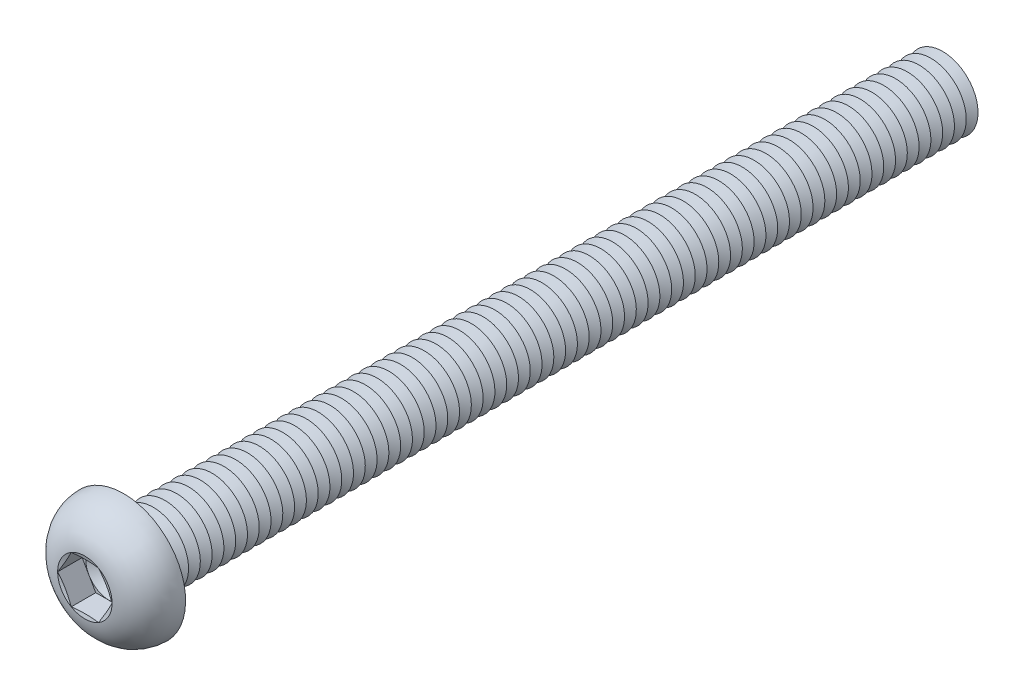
from build123d import *

# Parameters (mm, degrees)
FILLET1_R          = 0.5
LPATTERN1_COUNT    = 70
LPATTERN1_PITCH    = 1
CUT_EXTRUDE1_DEPTH = 2.08


with BuildPart() as part:
    # Sketch1 → Revolve1 (revolve)
    with BuildSketch(Plane(origin=(0, 0, 0), x_dir=(0, 0, -1), z_dir=(1, 0, 0))):
        with BuildLine():
            Line((0, 3), (0, 5.25))
            ThreePointArc((0, 5.25), (-2.210041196, 4.408189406), (-3.3, 2.3094))
            Line((-3.3, 2.3094), (-2.990599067, 1.1547))
            Line((-2.990599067, 1.1547), (-3.3, 1.1547))
            Line((-3.3, 1.1547), (-3.3, 0))
            Line((-3.3, 0), (70, 0))
            Line((70, 0), (70, 3))
            Line((70, 3), (0, 3))
        make_face()
    revolve(axis=Axis((0, 0, -70), (0, 0, 1)))

    # Fillet1
    fillet1_edges = [part.edges().sort_by_distance(p)[0] for p in [
        (0, -3, 0),
    ]]
    fillet(fillet1_edges, radius=FILLET1_R)

    # Sketch2 → Cut-Revolve1 (revolve, cut)
    with BuildSketch(Plane(origin=(0, 0, 0), x_dir=(0, 0, -1), z_dir=(1, 0, 0))):
        Polygon((69.5, 3), (70.5, 3), (70, 2.133974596), align=None)
    cut_revolve1 = revolve(axis=Axis((0, 0, -70), (0, 0, -1)), mode=Mode.SUBTRACT)

    # LPattern1: Cut-Revolve1 ×70
    with Locations(*[(0, 0, i * LPATTERN1_PITCH) for i in range(1, LPATTERN1_COUNT)]):
        add(cut_revolve1, mode=Mode.SUBTRACT)

    # Sketch3 → Cut-Extrude1 (cut)
    with BuildSketch(Plane.XY.offset(3.3)):
        Polygon((1.1547, 1.999999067), (-1.1547, 1.999999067), (-2.3094, 0), (-1.1547, -1.999999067), (1.1547, -1.999999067), (2.3094, 0), align=None)
    extrude(amount=-CUT_EXTRUDE1_DEPTH, mode=Mode.SUBTRACT)

    # Cut-Extrude2 cone 1 section (on through the dimple's axis) → Cut-Extrude2 (revolve, cut)
    with BuildSketch(Plane(origin=(0, 0, 1.22), x_dir=(0, -1, 0), z_dir=(1, 0, 0))):
        Polygon((0, 0), (1.999999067, 0), (0, 1.1547), align=None)
    revolve(axis=Axis((0, 0, 1.22), (0, 0, -1)), mode=Mode.SUBTRACT)


solid = part.part
